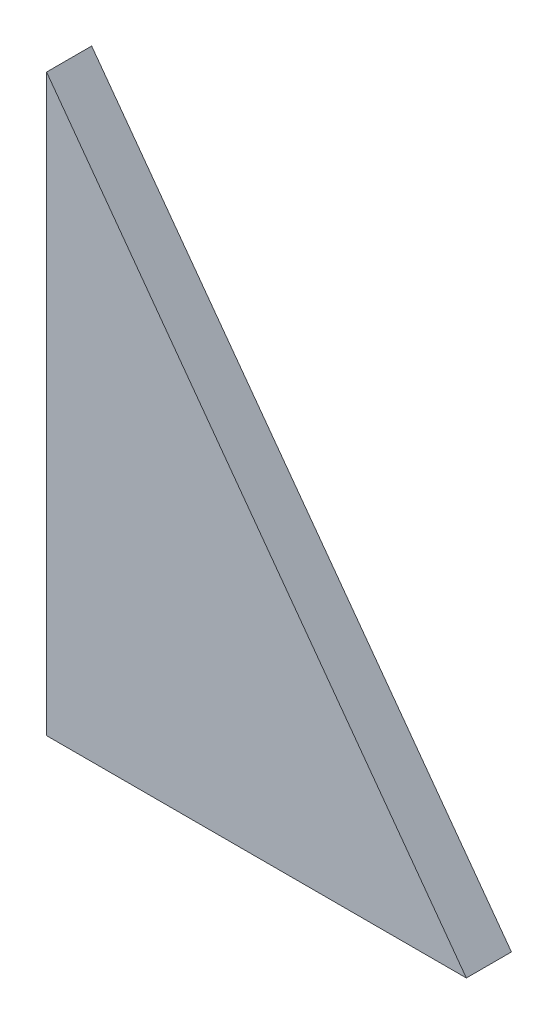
ISO-10303-21;
HEADER;
FILE_DESCRIPTION(('STEP AP214'),'2;1');
FILE_NAME('part.step','',(''),(''),'','','');
FILE_SCHEMA(('AUTOMOTIVE_DESIGN { 1 0 10303 214 1 1 1 1 }'));
ENDSEC;
DATA;
#1=APPLICATION_CONTEXT('core data for automotive mechanical design processes');
#2=APPLICATION_PROTOCOL_DEFINITION('international standard','automotive_design',2000,#1);
#3=PRODUCT_CONTEXT('',#1,'mechanical');
#4=PRODUCT('Part','Part','',(#3));
#5=PRODUCT_RELATED_PRODUCT_CATEGORY('part','',(#4));
#6=PRODUCT_DEFINITION_FORMATION('','',#4);
#7=PRODUCT_DEFINITION_CONTEXT('part definition',#1,'design');
#8=PRODUCT_DEFINITION('design','',#6,#7);
#9=PRODUCT_DEFINITION_SHAPE('','',#8);
#10=(LENGTH_UNIT() NAMED_UNIT(*) SI_UNIT(.MILLI.,.METRE.));
#11=(NAMED_UNIT(*) PLANE_ANGLE_UNIT() SI_UNIT($,.RADIAN.));
#12=(NAMED_UNIT(*) SI_UNIT($,.STERADIAN.) SOLID_ANGLE_UNIT());
#13=UNCERTAINTY_MEASURE_WITH_UNIT(LENGTH_MEASURE(1.E-05),#10,'distance_accuracy_value','');
#14=(GEOMETRIC_REPRESENTATION_CONTEXT(3) GLOBAL_UNCERTAINTY_ASSIGNED_CONTEXT((#13)) GLOBAL_UNIT_ASSIGNED_CONTEXT((#10,
#11,#12)) REPRESENTATION_CONTEXT('',''));
#15=CARTESIAN_POINT('',(0.,0.,0.));
#16=DIRECTION('',(0.,0.,1.));
#17=DIRECTION('',(1.,0.,0.));
#18=AXIS2_PLACEMENT_3D('',#15,#16,#17);
#19=CARTESIAN_POINT('',(80.40506709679,76.90506709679,16.));
#20=DIRECTION('',(0.,0.,1.));
#21=DIRECTION('',(1.,0.,0.));
#22=AXIS2_PLACEMENT_3D('',#19,#20,#21);
#23=PLANE('',#22);
#24=DIRECTION('',(1.,0.,0.));
#25=VECTOR('',#24,1.);
#26=CARTESIAN_POINT('',(31.,0.,16.));
#27=LINE('',#26,#25);
#28=CARTESIAN_POINT('',(31.,0.,16.));
#29=VERTEX_POINT('',#28);
#30=CARTESIAN_POINT('',(180.,0.,16.));
#31=VERTEX_POINT('',#30);
#32=EDGE_CURVE('E71',#29,#31,#27,.T.);
#33=ORIENTED_EDGE('',*,*,#32,.T.);
#34=DIRECTION('',(-0.589818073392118,0.807536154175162,0.));
#35=VECTOR('',#34,1.);
#36=CARTESIAN_POINT('',(180.,0.,16.));
#37=LINE('',#36,#35);
#38=CARTESIAN_POINT('',(31.,204.,16.));
#39=VERTEX_POINT('',#38);
#40=EDGE_CURVE('E60',#31,#39,#37,.T.);
#41=ORIENTED_EDGE('',*,*,#40,.T.);
#42=DIRECTION('',(0.,-1.,0.));
#43=VECTOR('',#42,1.);
#44=CARTESIAN_POINT('',(31.,204.,16.));
#45=LINE('',#44,#43);
#46=EDGE_CURVE('E10',#39,#29,#45,.T.);
#47=ORIENTED_EDGE('',*,*,#46,.T.);
#48=EDGE_LOOP('',(#33,#41,#47));
#49=FACE_BOUND('',#48,.T.);
#50=ADVANCED_FACE('F16',(#49),#23,.T.);
#51=CARTESIAN_POINT('',(80.40506709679,76.90506709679,0.));
#52=DIRECTION('',(0.,0.,1.));
#53=DIRECTION('',(1.,0.,0.));
#54=AXIS2_PLACEMENT_3D('',#51,#52,#53);
#55=PLANE('',#54);
#56=DIRECTION('',(0.,-1.,0.));
#57=VECTOR('',#56,1.);
#58=CARTESIAN_POINT('',(31.,204.,0.));
#59=LINE('',#58,#57);
#60=CARTESIAN_POINT('',(31.,204.,0.));
#61=VERTEX_POINT('',#60);
#62=CARTESIAN_POINT('',(31.,0.,0.));
#63=VERTEX_POINT('',#62);
#64=EDGE_CURVE('E19',#61,#63,#59,.T.);
#65=ORIENTED_EDGE('',*,*,#64,.F.);
#66=DIRECTION('',(-0.589818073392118,0.807536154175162,0.));
#67=VECTOR('',#66,1.);
#68=CARTESIAN_POINT('',(180.,0.,0.));
#69=LINE('',#68,#67);
#70=CARTESIAN_POINT('',(180.,0.,0.));
#71=VERTEX_POINT('',#70);
#72=EDGE_CURVE('E86',#71,#61,#69,.T.);
#73=ORIENTED_EDGE('',*,*,#72,.F.);
#74=DIRECTION('',(1.,0.,0.));
#75=VECTOR('',#74,1.);
#76=CARTESIAN_POINT('',(31.,0.,0.));
#77=LINE('',#76,#75);
#78=EDGE_CURVE('E78',#63,#71,#77,.T.);
#79=ORIENTED_EDGE('',*,*,#78,.F.);
#80=EDGE_LOOP('',(#65,#73,#79));
#81=FACE_BOUND('',#80,.T.);
#82=ADVANCED_FACE('F92',(#81),#55,.F.);
#83=CARTESIAN_POINT('',(31.,204.,0.));
#84=DIRECTION('',(1.,0.,0.));
#85=DIRECTION('',(0.,1.,0.));
#86=AXIS2_PLACEMENT_3D('',#83,#84,#85);
#87=PLANE('',#86);
#88=ORIENTED_EDGE('',*,*,#64,.T.);
#89=DIRECTION('',(0.,0.,1.));
#90=VECTOR('',#89,1.);
#91=CARTESIAN_POINT('',(31.,0.,0.));
#92=LINE('',#91,#90);
#93=EDGE_CURVE('E75',#63,#29,#92,.T.);
#94=ORIENTED_EDGE('',*,*,#93,.T.);
#95=ORIENTED_EDGE('',*,*,#46,.F.);
#96=DIRECTION('',(0.,0.,1.));
#97=VECTOR('',#96,1.);
#98=CARTESIAN_POINT('',(31.,204.,0.));
#99=LINE('',#98,#97);
#100=EDGE_CURVE('E67',#61,#39,#99,.T.);
#101=ORIENTED_EDGE('',*,*,#100,.F.);
#102=EDGE_LOOP('',(#88,#94,#95,#101));
#103=FACE_BOUND('',#102,.T.);
#104=ADVANCED_FACE('F95',(#103),#87,.F.);
#105=CARTESIAN_POINT('',(180.,0.,0.));
#106=DIRECTION('',(-0.807536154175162,-0.589818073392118,0.));
#107=DIRECTION('',(-0.589818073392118,0.807536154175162,0.));
#108=AXIS2_PLACEMENT_3D('',#105,#106,#107);
#109=PLANE('',#108);
#110=ORIENTED_EDGE('',*,*,#72,.T.);
#111=ORIENTED_EDGE('',*,*,#100,.T.);
#112=ORIENTED_EDGE('',*,*,#40,.F.);
#113=DIRECTION('',(0.,0.,1.));
#114=VECTOR('',#113,1.);
#115=CARTESIAN_POINT('',(180.,0.,0.));
#116=LINE('',#115,#114);
#117=EDGE_CURVE('E65',#71,#31,#116,.T.);
#118=ORIENTED_EDGE('',*,*,#117,.F.);
#119=EDGE_LOOP('',(#110,#111,#112,#118));
#120=FACE_BOUND('',#119,.T.);
#121=ADVANCED_FACE('F63',(#120),#109,.F.);
#122=CARTESIAN_POINT('',(31.,0.,0.));
#123=DIRECTION('',(0.,1.,0.));
#124=DIRECTION('',(1.,0.,0.));
#125=AXIS2_PLACEMENT_3D('',#122,#123,#124);
#126=PLANE('',#125);
#127=ORIENTED_EDGE('',*,*,#78,.T.);
#128=ORIENTED_EDGE('',*,*,#117,.T.);
#129=ORIENTED_EDGE('',*,*,#32,.F.);
#130=ORIENTED_EDGE('',*,*,#93,.F.);
#131=EDGE_LOOP('',(#127,#128,#129,#130));
#132=FACE_BOUND('',#131,.T.);
#133=ADVANCED_FACE('F77',(#132),#126,.F.);
#134=CLOSED_SHELL('',(#50,#82,#104,#121,#133));
#135=MANIFOLD_SOLID_BREP('B1',#134);
#136=ADVANCED_BREP_SHAPE_REPRESENTATION('',(#18,#135),#14);
#137=SHAPE_DEFINITION_REPRESENTATION(#9,#136);
ENDSEC;
END-ISO-10303-21;
